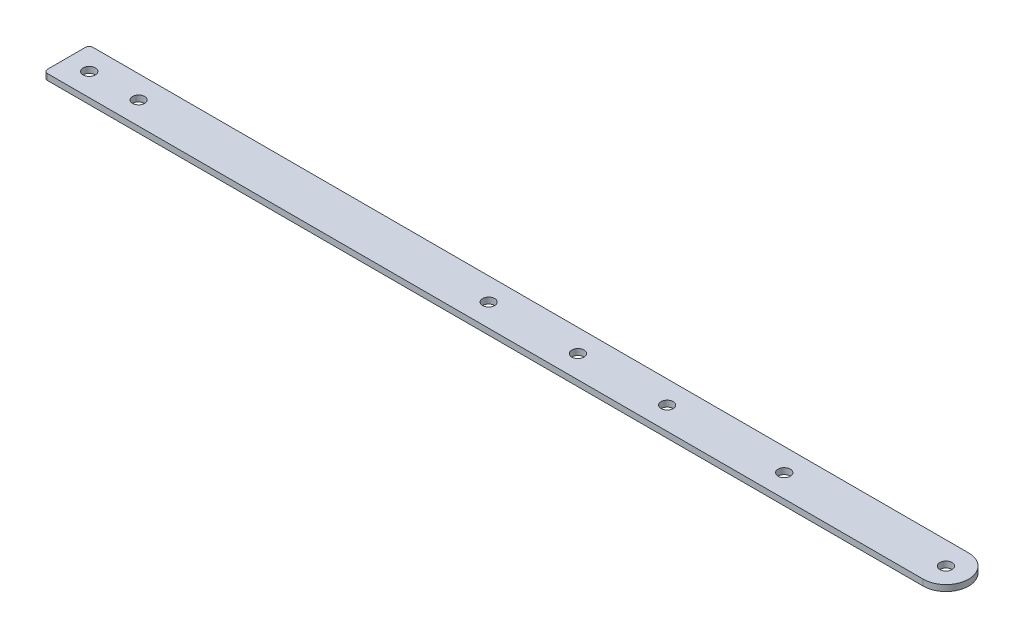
ISO-10303-21;
HEADER;
FILE_DESCRIPTION(('STEP AP214'),'2;1');
FILE_NAME('part.step','',(''),(''),'','','');
FILE_SCHEMA(('AUTOMOTIVE_DESIGN { 1 0 10303 214 1 1 1 1 }'));
ENDSEC;
DATA;
#1=APPLICATION_CONTEXT('core data for automotive mechanical design processes');
#2=APPLICATION_PROTOCOL_DEFINITION('international standard','automotive_design',2000,#1);
#3=PRODUCT_CONTEXT('',#1,'mechanical');
#4=PRODUCT('Part','Part','',(#3));
#5=PRODUCT_RELATED_PRODUCT_CATEGORY('part','',(#4));
#6=PRODUCT_DEFINITION_FORMATION('','',#4);
#7=PRODUCT_DEFINITION_CONTEXT('part definition',#1,'design');
#8=PRODUCT_DEFINITION('design','',#6,#7);
#9=PRODUCT_DEFINITION_SHAPE('','',#8);
#10=(LENGTH_UNIT() NAMED_UNIT(*) SI_UNIT(.MILLI.,.METRE.));
#11=(NAMED_UNIT(*) PLANE_ANGLE_UNIT() SI_UNIT($,.RADIAN.));
#12=(NAMED_UNIT(*) SI_UNIT($,.STERADIAN.) SOLID_ANGLE_UNIT());
#13=UNCERTAINTY_MEASURE_WITH_UNIT(LENGTH_MEASURE(1.E-05),#10,'distance_accuracy_value','');
#14=(GEOMETRIC_REPRESENTATION_CONTEXT(3) GLOBAL_UNCERTAINTY_ASSIGNED_CONTEXT((#13)) GLOBAL_UNIT_ASSIGNED_CONTEXT((#10,
#11,#12)) REPRESENTATION_CONTEXT('',''));
#15=CARTESIAN_POINT('',(0.,0.,0.));
#16=DIRECTION('',(0.,0.,1.));
#17=DIRECTION('',(1.,0.,0.));
#18=AXIS2_PLACEMENT_3D('',#15,#16,#17);
#19=CARTESIAN_POINT('',(1483.56169288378,4.,-2004.05334639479));
#20=DIRECTION('',(0.,1.,0.));
#21=DIRECTION('',(0.,0.,1.));
#22=AXIS2_PLACEMENT_3D('',#19,#20,#21);
#23=PLANE('',#22);
#24=CARTESIAN_POINT('',(1877.67003879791,4.,-2016.55334639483));
#25=DIRECTION('',(0.,1.,0.));
#26=DIRECTION('',(0.,0.,1.));
#27=AXIS2_PLACEMENT_3D('',#24,#25,#26);
#28=CIRCLE('',#27,3.99999999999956);
#29=CARTESIAN_POINT('',(1877.67003879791,4.,-2012.55334639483));
#30=VERTEX_POINT('',#29);
#31=EDGE_CURVE('E201',#30,#30,#28,.T.);
#32=ORIENTED_EDGE('',*,*,#31,.F.);
#33=EDGE_LOOP('',(#32));
#34=FACE_BOUND('',#33,.T.);
#35=CARTESIAN_POINT('',(1954.97920122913,4.,-2016.55334639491));
#36=DIRECTION('',(0.,1.,0.));
#37=DIRECTION('',(0.,0.,1.));
#38=AXIS2_PLACEMENT_3D('',#35,#36,#37);
#39=CIRCLE('',#38,4.05000000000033);
#40=CARTESIAN_POINT('',(1954.97920122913,4.,-2012.50334639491));
#41=VERTEX_POINT('',#40);
#42=EDGE_CURVE('E213',#41,#41,#39,.T.);
#43=ORIENTED_EDGE('',*,*,#42,.F.);
#44=EDGE_LOOP('',(#43));
#45=FACE_BOUND('',#44,.T.);
#46=CARTESIAN_POINT('',(1496.06169288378,4.,-2016.5533463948));
#47=DIRECTION('',(0.,1.,0.));
#48=DIRECTION('',(0.,0.,1.));
#49=AXIS2_PLACEMENT_3D('',#46,#47,#48);
#50=CIRCLE('',#49,4.04999999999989);
#51=CARTESIAN_POINT('',(1496.06169288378,4.,-2012.5033463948));
#52=VERTEX_POINT('',#51);
#53=EDGE_CURVE('E225',#52,#52,#50,.T.);
#54=ORIENTED_EDGE('',*,*,#53,.F.);
#55=EDGE_LOOP('',(#54));
#56=FACE_BOUND('',#55,.T.);
#57=CARTESIAN_POINT('',(1483.56169288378,4.,-2004.05334639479));
#58=DIRECTION('',(0.,1.,0.));
#59=DIRECTION('',(0.,0.,1.));
#60=AXIS2_PLACEMENT_3D('',#57,#58,#59);
#61=CIRCLE('',#60,2.49999999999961);
#62=CARTESIAN_POINT('',(1481.06169288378,4.,-2004.05334639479));
#63=VERTEX_POINT('',#62);
#64=CARTESIAN_POINT('',(1483.56169288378,4.,-2001.55334639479));
#65=VERTEX_POINT('',#64);
#66=EDGE_CURVE('E128',#63,#65,#61,.T.);
#67=ORIENTED_EDGE('',*,*,#66,.T.);
#68=DIRECTION('',(1.,0.,0.));
#69=VECTOR('',#68,1.);
#70=CARTESIAN_POINT('',(1483.56169288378,4.,-2001.55334639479));
#71=LINE('',#70,#69);
#72=CARTESIAN_POINT('',(2061.74711783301,4.,-2001.55334639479));
#73=VERTEX_POINT('',#72);
#74=EDGE_CURVE('E86',#65,#73,#71,.T.);
#75=ORIENTED_EDGE('',*,*,#74,.T.);
#76=CARTESIAN_POINT('',(2061.74711782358,4.,-2016.55334640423));
#77=DIRECTION('',(0.,1.,0.));
#78=DIRECTION('',(0.,0.,1.));
#79=AXIS2_PLACEMENT_3D('',#76,#77,#78);
#80=CIRCLE('',#79,15.0000000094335);
#81=CARTESIAN_POINT('',(2061.74711781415,4.,-2031.55334641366));
#82=VERTEX_POINT('',#81);
#83=EDGE_CURVE('E99',#73,#82,#80,.T.);
#84=ORIENTED_EDGE('',*,*,#83,.T.);
#85=DIRECTION('',(-1.,0.,0.));
#86=VECTOR('',#85,1.);
#87=CARTESIAN_POINT('',(1483.56169288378,4.,-2031.55334641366));
#88=LINE('',#87,#86);
#89=CARTESIAN_POINT('',(1483.56169288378,4.,-2031.55334641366));
#90=VERTEX_POINT('',#89);
#91=EDGE_CURVE('E93',#82,#90,#88,.T.);
#92=ORIENTED_EDGE('',*,*,#91,.T.);
#93=CARTESIAN_POINT('',(1483.56169288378,4.,-2029.05334641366));
#94=DIRECTION('',(0.,1.,0.));
#95=DIRECTION('',(0.,0.,1.));
#96=AXIS2_PLACEMENT_3D('',#93,#94,#95);
#97=CIRCLE('',#96,2.50000000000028);
#98=CARTESIAN_POINT('',(1481.06169288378,4.,-2029.05334641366));
#99=VERTEX_POINT('',#98);
#100=EDGE_CURVE('E97',#90,#99,#97,.T.);
#101=ORIENTED_EDGE('',*,*,#100,.T.);
#102=DIRECTION('',(0.,0.,1.));
#103=VECTOR('',#102,1.);
#104=CARTESIAN_POINT('',(1481.06169288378,4.,-2004.05334639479));
#105=LINE('',#104,#103);
#106=EDGE_CURVE('E49',#99,#63,#105,.T.);
#107=ORIENTED_EDGE('',*,*,#106,.T.);
#108=EDGE_LOOP('',(#67,#75,#84,#92,#101,#107));
#109=FACE_BOUND('',#108,.T.);
#110=CARTESIAN_POINT('',(1528.6669663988,4.,-2016.553346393));
#111=DIRECTION('',(0.,1.,0.));
#112=DIRECTION('',(0.,0.,1.));
#113=AXIS2_PLACEMENT_3D('',#110,#111,#112);
#114=CIRCLE('',#113,3.99999999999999);
#115=CARTESIAN_POINT('',(1528.6669663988,4.,-2012.553346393));
#116=VERTEX_POINT('',#115);
#117=EDGE_CURVE('E121',#116,#116,#114,.T.);
#118=ORIENTED_EDGE('',*,*,#117,.F.);
#119=EDGE_LOOP('',(#118));
#120=FACE_BOUND('',#119,.T.);
#121=CARTESIAN_POINT('',(2061.74711782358,4.,-2016.55334640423));
#122=DIRECTION('',(0.,1.,0.));
#123=DIRECTION('',(0.,0.,1.));
#124=AXIS2_PLACEMENT_3D('',#121,#122,#123);
#125=CIRCLE('',#124,4.04999999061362);
#126=CARTESIAN_POINT('',(2061.74711782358,4.,-2012.50334641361));
#127=VERTEX_POINT('',#126);
#128=EDGE_CURVE('E219',#127,#127,#125,.T.);
#129=ORIENTED_EDGE('',*,*,#128,.F.);
#130=EDGE_LOOP('',(#129));
#131=FACE_BOUND('',#130,.T.);
#132=CARTESIAN_POINT('',(1818.75253045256,4.,-2016.55334639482));
#133=DIRECTION('',(0.,1.,0.));
#134=DIRECTION('',(0.,0.,1.));
#135=AXIS2_PLACEMENT_3D('',#132,#133,#134);
#136=CIRCLE('',#135,4.04999999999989);
#137=CARTESIAN_POINT('',(1818.75253045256,4.,-2012.50334639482));
#138=VERTEX_POINT('',#137);
#139=EDGE_CURVE('E207',#138,#138,#136,.T.);
#140=ORIENTED_EDGE('',*,*,#139,.F.);
#141=EDGE_LOOP('',(#140));
#142=FACE_BOUND('',#141,.T.);
#143=CARTESIAN_POINT('',(1759.83502210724,4.,-2016.55334639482));
#144=DIRECTION('',(0.,1.,0.));
#145=DIRECTION('',(0.,0.,1.));
#146=AXIS2_PLACEMENT_3D('',#143,#144,#145);
#147=CIRCLE('',#146,4.);
#148=CARTESIAN_POINT('',(1759.83502210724,4.,-2012.55334639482));
#149=VERTEX_POINT('',#148);
#150=EDGE_CURVE('E192',#149,#149,#147,.T.);
#151=ORIENTED_EDGE('',*,*,#150,.F.);
#152=EDGE_LOOP('',(#151));
#153=FACE_BOUND('',#152,.T.);
#154=ADVANCED_FACE('F32',(#34,#45,#56,#109,#120,#131,#142,#153),#23,.T.);
#155=CARTESIAN_POINT('',(1483.56169288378,0.,-2004.05334639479));
#156=DIRECTION('',(0.,1.,0.));
#157=DIRECTION('',(0.,0.,1.));
#158=AXIS2_PLACEMENT_3D('',#155,#156,#157);
#159=PLANE('',#158);
#160=CARTESIAN_POINT('',(1877.67003879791,0.,-2016.55334639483));
#161=DIRECTION('',(0.,1.,0.));
#162=DIRECTION('',(0.,0.,1.));
#163=AXIS2_PLACEMENT_3D('',#160,#161,#162);
#164=CIRCLE('',#163,3.99999999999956);
#165=CARTESIAN_POINT('',(1877.67003879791,0.,-2012.55334639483));
#166=VERTEX_POINT('',#165);
#167=EDGE_CURVE('E198',#166,#166,#164,.T.);
#168=ORIENTED_EDGE('',*,*,#167,.T.);
#169=EDGE_LOOP('',(#168));
#170=FACE_BOUND('',#169,.T.);
#171=CARTESIAN_POINT('',(1954.97920122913,0.,-2016.55334639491));
#172=DIRECTION('',(0.,1.,0.));
#173=DIRECTION('',(0.,0.,1.));
#174=AXIS2_PLACEMENT_3D('',#171,#172,#173);
#175=CIRCLE('',#174,4.05000000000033);
#176=CARTESIAN_POINT('',(1954.97920122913,0.,-2012.50334639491));
#177=VERTEX_POINT('',#176);
#178=EDGE_CURVE('E210',#177,#177,#175,.T.);
#179=ORIENTED_EDGE('',*,*,#178,.T.);
#180=EDGE_LOOP('',(#179));
#181=FACE_BOUND('',#180,.T.);
#182=CARTESIAN_POINT('',(1496.06169288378,0.,-2016.5533463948));
#183=DIRECTION('',(0.,1.,0.));
#184=DIRECTION('',(0.,0.,1.));
#185=AXIS2_PLACEMENT_3D('',#182,#183,#184);
#186=CIRCLE('',#185,4.04999999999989);
#187=CARTESIAN_POINT('',(1496.06169288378,0.,-2012.5033463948));
#188=VERTEX_POINT('',#187);
#189=EDGE_CURVE('E222',#188,#188,#186,.T.);
#190=ORIENTED_EDGE('',*,*,#189,.T.);
#191=EDGE_LOOP('',(#190));
#192=FACE_BOUND('',#191,.T.);
#193=CARTESIAN_POINT('',(1483.56169288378,0.,-2004.05334639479));
#194=DIRECTION('',(0.,1.,0.));
#195=DIRECTION('',(0.,0.,1.));
#196=AXIS2_PLACEMENT_3D('',#193,#194,#195);
#197=CIRCLE('',#196,2.49999999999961);
#198=CARTESIAN_POINT('',(1481.06169288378,0.,-2004.05334639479));
#199=VERTEX_POINT('',#198);
#200=CARTESIAN_POINT('',(1483.56169288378,0.,-2001.55334639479));
#201=VERTEX_POINT('',#200);
#202=EDGE_CURVE('E117',#199,#201,#197,.T.);
#203=ORIENTED_EDGE('',*,*,#202,.F.);
#204=DIRECTION('',(0.,0.,1.));
#205=VECTOR('',#204,1.);
#206=CARTESIAN_POINT('',(1481.06169288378,0.,-2004.05334639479));
#207=LINE('',#206,#205);
#208=CARTESIAN_POINT('',(1481.06169288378,0.,-2029.05334641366));
#209=VERTEX_POINT('',#208);
#210=EDGE_CURVE('E78',#209,#199,#207,.T.);
#211=ORIENTED_EDGE('',*,*,#210,.F.);
#212=CARTESIAN_POINT('',(1483.56169288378,0.,-2029.05334641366));
#213=DIRECTION('',(0.,1.,0.));
#214=DIRECTION('',(0.,0.,1.));
#215=AXIS2_PLACEMENT_3D('',#212,#213,#214);
#216=CIRCLE('',#215,2.50000000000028);
#217=CARTESIAN_POINT('',(1483.56169288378,0.,-2031.55334641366));
#218=VERTEX_POINT('',#217);
#219=EDGE_CURVE('E72',#218,#209,#216,.T.);
#220=ORIENTED_EDGE('',*,*,#219,.F.);
#221=DIRECTION('',(-1.,0.,0.));
#222=VECTOR('',#221,1.);
#223=CARTESIAN_POINT('',(1483.56169288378,0.,-2031.55334641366));
#224=LINE('',#223,#222);
#225=CARTESIAN_POINT('',(2061.74711781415,0.,-2031.55334641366));
#226=VERTEX_POINT('',#225);
#227=EDGE_CURVE('E107',#226,#218,#224,.T.);
#228=ORIENTED_EDGE('',*,*,#227,.F.);
#229=CARTESIAN_POINT('',(2061.74711782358,0.,-2016.55334640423));
#230=DIRECTION('',(0.,1.,0.));
#231=DIRECTION('',(0.,0.,1.));
#232=AXIS2_PLACEMENT_3D('',#229,#230,#231);
#233=CIRCLE('',#232,15.0000000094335);
#234=CARTESIAN_POINT('',(2061.74711783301,0.,-2001.55334639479));
#235=VERTEX_POINT('',#234);
#236=EDGE_CURVE('E123',#235,#226,#233,.T.);
#237=ORIENTED_EDGE('',*,*,#236,.F.);
#238=DIRECTION('',(1.,0.,0.));
#239=VECTOR('',#238,1.);
#240=CARTESIAN_POINT('',(1483.56169288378,0.,-2001.55334639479));
#241=LINE('',#240,#239);
#242=EDGE_CURVE('E120',#201,#235,#241,.T.);
#243=ORIENTED_EDGE('',*,*,#242,.F.);
#244=EDGE_LOOP('',(#203,#211,#220,#228,#237,#243));
#245=FACE_BOUND('',#244,.T.);
#246=CARTESIAN_POINT('',(1528.6669663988,0.,-2016.553346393));
#247=DIRECTION('',(0.,1.,0.));
#248=DIRECTION('',(0.,0.,1.));
#249=AXIS2_PLACEMENT_3D('',#246,#247,#248);
#250=CIRCLE('',#249,3.99999999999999);
#251=CARTESIAN_POINT('',(1528.6669663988,0.,-2012.553346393));
#252=VERTEX_POINT('',#251);
#253=EDGE_CURVE('E228',#252,#252,#250,.T.);
#254=ORIENTED_EDGE('',*,*,#253,.T.);
#255=EDGE_LOOP('',(#254));
#256=FACE_BOUND('',#255,.T.);
#257=CARTESIAN_POINT('',(2061.74711782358,0.,-2016.55334640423));
#258=DIRECTION('',(0.,1.,0.));
#259=DIRECTION('',(0.,0.,1.));
#260=AXIS2_PLACEMENT_3D('',#257,#258,#259);
#261=CIRCLE('',#260,4.04999999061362);
#262=CARTESIAN_POINT('',(2061.74711782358,0.,-2012.50334641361));
#263=VERTEX_POINT('',#262);
#264=EDGE_CURVE('E216',#263,#263,#261,.T.);
#265=ORIENTED_EDGE('',*,*,#264,.T.);
#266=EDGE_LOOP('',(#265));
#267=FACE_BOUND('',#266,.T.);
#268=CARTESIAN_POINT('',(1818.75253045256,0.,-2016.55334639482));
#269=DIRECTION('',(0.,1.,0.));
#270=DIRECTION('',(0.,0.,1.));
#271=AXIS2_PLACEMENT_3D('',#268,#269,#270);
#272=CIRCLE('',#271,4.04999999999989);
#273=CARTESIAN_POINT('',(1818.75253045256,0.,-2012.50334639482));
#274=VERTEX_POINT('',#273);
#275=EDGE_CURVE('E204',#274,#274,#272,.T.);
#276=ORIENTED_EDGE('',*,*,#275,.T.);
#277=EDGE_LOOP('',(#276));
#278=FACE_BOUND('',#277,.T.);
#279=CARTESIAN_POINT('',(1759.83502210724,0.,-2016.55334639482));
#280=DIRECTION('',(0.,1.,0.));
#281=DIRECTION('',(0.,0.,1.));
#282=AXIS2_PLACEMENT_3D('',#279,#280,#281);
#283=CIRCLE('',#282,4.);
#284=CARTESIAN_POINT('',(1759.83502210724,0.,-2012.55334639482));
#285=VERTEX_POINT('',#284);
#286=EDGE_CURVE('E195',#285,#285,#283,.T.);
#287=ORIENTED_EDGE('',*,*,#286,.T.);
#288=EDGE_LOOP('',(#287));
#289=FACE_BOUND('',#288,.T.);
#290=ADVANCED_FACE('F137',(#170,#181,#192,#245,#256,#267,#278,#289),#159,.F.);
#291=CARTESIAN_POINT('',(1483.56169288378,4.,-2004.05334639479));
#292=DIRECTION('',(0.,-1.,0.));
#293=DIRECTION('',(0.,0.,-1.));
#294=AXIS2_PLACEMENT_3D('',#291,#292,#293);
#295=CYLINDRICAL_SURFACE('',#294,2.49999999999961);
#296=ORIENTED_EDGE('',*,*,#202,.T.);
#297=DIRECTION('',(0.,-1.,0.));
#298=VECTOR('',#297,1.);
#299=CARTESIAN_POINT('',(1483.56169288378,4.,-2001.55334639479));
#300=LINE('',#299,#298);
#301=EDGE_CURVE('E11',#65,#201,#300,.T.);
#302=ORIENTED_EDGE('',*,*,#301,.F.);
#303=ORIENTED_EDGE('',*,*,#66,.F.);
#304=DIRECTION('',(0.,-1.,0.));
#305=VECTOR('',#304,1.);
#306=CARTESIAN_POINT('',(1481.06169288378,4.,-2004.05334639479));
#307=LINE('',#306,#305);
#308=EDGE_CURVE('E113',#63,#199,#307,.T.);
#309=ORIENTED_EDGE('',*,*,#308,.T.);
#310=EDGE_LOOP('',(#296,#302,#303,#309));
#311=FACE_BOUND('',#310,.T.);
#312=ADVANCED_FACE('F34',(#311),#295,.T.);
#313=CARTESIAN_POINT('',(1483.56169288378,4.,-2001.55334639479));
#314=DIRECTION('',(0.,0.,-1.));
#315=DIRECTION('',(-1.,0.,0.));
#316=AXIS2_PLACEMENT_3D('',#313,#314,#315);
#317=PLANE('',#316);
#318=ORIENTED_EDGE('',*,*,#242,.T.);
#319=DIRECTION('',(0.,-1.,0.));
#320=VECTOR('',#319,1.);
#321=CARTESIAN_POINT('',(2061.74711783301,4.,-2001.55334639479));
#322=LINE('',#321,#320);
#323=EDGE_CURVE('E41',#73,#235,#322,.T.);
#324=ORIENTED_EDGE('',*,*,#323,.F.);
#325=ORIENTED_EDGE('',*,*,#74,.F.);
#326=ORIENTED_EDGE('',*,*,#301,.T.);
#327=EDGE_LOOP('',(#318,#324,#325,#326));
#328=FACE_BOUND('',#327,.T.);
#329=ADVANCED_FACE('F312',(#328),#317,.F.);
#330=CARTESIAN_POINT('',(2061.74711782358,4.,-2016.55334640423));
#331=DIRECTION('',(0.,-1.,0.));
#332=DIRECTION('',(0.,0.,-1.));
#333=AXIS2_PLACEMENT_3D('',#330,#331,#332);
#334=CYLINDRICAL_SURFACE('',#333,15.0000000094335);
#335=ORIENTED_EDGE('',*,*,#236,.T.);
#336=DIRECTION('',(0.,-1.,0.));
#337=VECTOR('',#336,1.);
#338=CARTESIAN_POINT('',(2061.74711781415,4.,-2031.55334641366));
#339=LINE('',#338,#337);
#340=EDGE_CURVE('E108',#82,#226,#339,.T.);
#341=ORIENTED_EDGE('',*,*,#340,.F.);
#342=ORIENTED_EDGE('',*,*,#83,.F.);
#343=ORIENTED_EDGE('',*,*,#323,.T.);
#344=EDGE_LOOP('',(#335,#341,#342,#343));
#345=FACE_BOUND('',#344,.T.);
#346=ADVANCED_FACE('F134',(#345),#334,.T.);
#347=CARTESIAN_POINT('',(1483.56169288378,4.,-2031.55334641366));
#348=DIRECTION('',(0.,0.,1.));
#349=DIRECTION('',(1.,0.,0.));
#350=AXIS2_PLACEMENT_3D('',#347,#348,#349);
#351=PLANE('',#350);
#352=ORIENTED_EDGE('',*,*,#227,.T.);
#353=DIRECTION('',(0.,-1.,0.));
#354=VECTOR('',#353,1.);
#355=CARTESIAN_POINT('',(1483.56169288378,4.,-2031.55334641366));
#356=LINE('',#355,#354);
#357=EDGE_CURVE('E104',#90,#218,#356,.T.);
#358=ORIENTED_EDGE('',*,*,#357,.F.);
#359=ORIENTED_EDGE('',*,*,#91,.F.);
#360=ORIENTED_EDGE('',*,*,#340,.T.);
#361=EDGE_LOOP('',(#352,#358,#359,#360));
#362=FACE_BOUND('',#361,.T.);
#363=ADVANCED_FACE('F105',(#362),#351,.F.);
#364=CARTESIAN_POINT('',(1483.56169288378,4.,-2029.05334641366));
#365=DIRECTION('',(0.,-1.,0.));
#366=DIRECTION('',(0.,0.,-1.));
#367=AXIS2_PLACEMENT_3D('',#364,#365,#366);
#368=CYLINDRICAL_SURFACE('',#367,2.50000000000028);
#369=ORIENTED_EDGE('',*,*,#219,.T.);
#370=DIRECTION('',(0.,-1.,0.));
#371=VECTOR('',#370,1.);
#372=CARTESIAN_POINT('',(1481.06169288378,4.,-2029.05334641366));
#373=LINE('',#372,#371);
#374=EDGE_CURVE('E109',#99,#209,#373,.T.);
#375=ORIENTED_EDGE('',*,*,#374,.F.);
#376=ORIENTED_EDGE('',*,*,#100,.F.);
#377=ORIENTED_EDGE('',*,*,#357,.T.);
#378=EDGE_LOOP('',(#369,#375,#376,#377));
#379=FACE_BOUND('',#378,.T.);
#380=ADVANCED_FACE('F111',(#379),#368,.T.);
#381=CARTESIAN_POINT('',(1481.06169288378,4.,-2004.05334639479));
#382=DIRECTION('',(1.,0.,0.));
#383=DIRECTION('',(0.,0.,-1.));
#384=AXIS2_PLACEMENT_3D('',#381,#382,#383);
#385=PLANE('',#384);
#386=ORIENTED_EDGE('',*,*,#210,.T.);
#387=ORIENTED_EDGE('',*,*,#308,.F.);
#388=ORIENTED_EDGE('',*,*,#106,.F.);
#389=ORIENTED_EDGE('',*,*,#374,.T.);
#390=EDGE_LOOP('',(#386,#387,#388,#389));
#391=FACE_BOUND('',#390,.T.);
#392=ADVANCED_FACE('F142',(#391),#385,.F.);
#393=CARTESIAN_POINT('',(1528.6669663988,4.,-2016.553346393));
#394=DIRECTION('',(0.,-1.,0.));
#395=DIRECTION('',(0.,0.,-1.));
#396=AXIS2_PLACEMENT_3D('',#393,#394,#395);
#397=CYLINDRICAL_SURFACE('',#396,3.99999999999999);
#398=ORIENTED_EDGE('',*,*,#117,.T.);
#399=EDGE_LOOP('',(#398));
#400=FACE_BOUND('',#399,.T.);
#401=ORIENTED_EDGE('',*,*,#253,.F.);
#402=EDGE_LOOP('',(#401));
#403=FACE_BOUND('',#402,.T.);
#404=ADVANCED_FACE('F144',(#400,#403),#397,.F.);
#405=CARTESIAN_POINT('',(1496.06169288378,4.,-2016.5533463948));
#406=DIRECTION('',(0.,-1.,0.));
#407=DIRECTION('',(0.,0.,-1.));
#408=AXIS2_PLACEMENT_3D('',#405,#406,#407);
#409=CYLINDRICAL_SURFACE('',#408,4.04999999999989);
#410=ORIENTED_EDGE('',*,*,#53,.T.);
#411=EDGE_LOOP('',(#410));
#412=FACE_BOUND('',#411,.T.);
#413=ORIENTED_EDGE('',*,*,#189,.F.);
#414=EDGE_LOOP('',(#413));
#415=FACE_BOUND('',#414,.T.);
#416=ADVANCED_FACE('F150',(#412,#415),#409,.F.);
#417=CARTESIAN_POINT('',(2061.74711782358,4.,-2016.55334640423));
#418=DIRECTION('',(0.,-1.,0.));
#419=DIRECTION('',(0.,0.,-1.));
#420=AXIS2_PLACEMENT_3D('',#417,#418,#419);
#421=CYLINDRICAL_SURFACE('',#420,4.04999999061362);
#422=ORIENTED_EDGE('',*,*,#128,.T.);
#423=EDGE_LOOP('',(#422));
#424=FACE_BOUND('',#423,.T.);
#425=ORIENTED_EDGE('',*,*,#264,.F.);
#426=EDGE_LOOP('',(#425));
#427=FACE_BOUND('',#426,.T.);
#428=ADVANCED_FACE('F167',(#424,#427),#421,.F.);
#429=CARTESIAN_POINT('',(1954.97920122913,4.,-2016.55334639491));
#430=DIRECTION('',(0.,-1.,0.));
#431=DIRECTION('',(0.,0.,-1.));
#432=AXIS2_PLACEMENT_3D('',#429,#430,#431);
#433=CYLINDRICAL_SURFACE('',#432,4.05000000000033);
#434=ORIENTED_EDGE('',*,*,#42,.T.);
#435=EDGE_LOOP('',(#434));
#436=FACE_BOUND('',#435,.T.);
#437=ORIENTED_EDGE('',*,*,#178,.F.);
#438=EDGE_LOOP('',(#437));
#439=FACE_BOUND('',#438,.T.);
#440=ADVANCED_FACE('F171',(#436,#439),#433,.F.);
#441=CARTESIAN_POINT('',(1818.75253045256,4.,-2016.55334639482));
#442=DIRECTION('',(0.,-1.,0.));
#443=DIRECTION('',(0.,0.,-1.));
#444=AXIS2_PLACEMENT_3D('',#441,#442,#443);
#445=CYLINDRICAL_SURFACE('',#444,4.04999999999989);
#446=ORIENTED_EDGE('',*,*,#139,.T.);
#447=EDGE_LOOP('',(#446));
#448=FACE_BOUND('',#447,.T.);
#449=ORIENTED_EDGE('',*,*,#275,.F.);
#450=EDGE_LOOP('',(#449));
#451=FACE_BOUND('',#450,.T.);
#452=ADVANCED_FACE('F175',(#448,#451),#445,.F.);
#453=CARTESIAN_POINT('',(1877.67003879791,4.,-2016.55334639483));
#454=DIRECTION('',(0.,-1.,0.));
#455=DIRECTION('',(0.,0.,-1.));
#456=AXIS2_PLACEMENT_3D('',#453,#454,#455);
#457=CYLINDRICAL_SURFACE('',#456,3.99999999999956);
#458=ORIENTED_EDGE('',*,*,#31,.T.);
#459=EDGE_LOOP('',(#458));
#460=FACE_BOUND('',#459,.T.);
#461=ORIENTED_EDGE('',*,*,#167,.F.);
#462=EDGE_LOOP('',(#461));
#463=FACE_BOUND('',#462,.T.);
#464=ADVANCED_FACE('F179',(#460,#463),#457,.F.);
#465=CARTESIAN_POINT('',(1759.83502210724,4.,-2016.55334639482));
#466=DIRECTION('',(0.,-1.,0.));
#467=DIRECTION('',(0.,0.,-1.));
#468=AXIS2_PLACEMENT_3D('',#465,#466,#467);
#469=CYLINDRICAL_SURFACE('',#468,4.);
#470=ORIENTED_EDGE('',*,*,#150,.T.);
#471=EDGE_LOOP('',(#470));
#472=FACE_BOUND('',#471,.T.);
#473=ORIENTED_EDGE('',*,*,#286,.F.);
#474=EDGE_LOOP('',(#473));
#475=FACE_BOUND('',#474,.T.);
#476=ADVANCED_FACE('F183',(#472,#475),#469,.F.);
#477=CLOSED_SHELL('',(#154,#290,#312,#329,#346,#363,#380,#392,#404,#416,#428,#440,#452,#464,#476));
#478=MANIFOLD_SOLID_BREP('B2',#477);
#479=ADVANCED_BREP_SHAPE_REPRESENTATION('',(#18,#478),#14);
#480=SHAPE_DEFINITION_REPRESENTATION(#9,#479);
ENDSEC;
END-ISO-10303-21;
